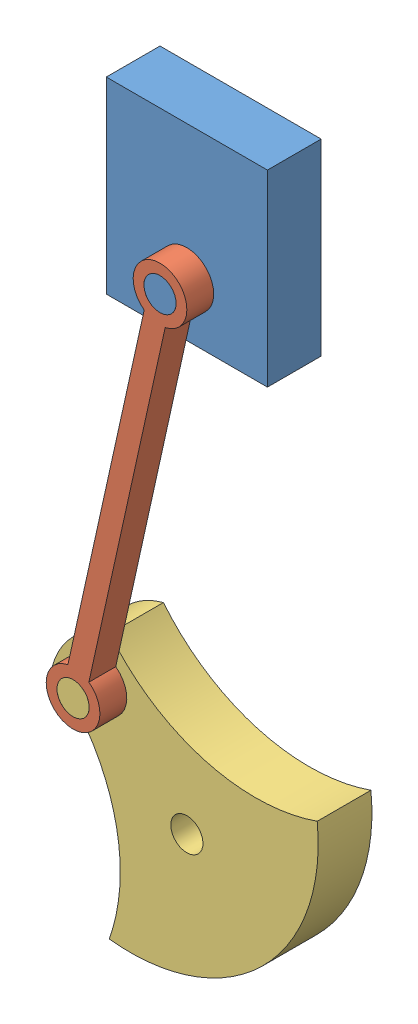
SolidWorks assembly c02_tut01.SLDASM, configuration Default (file format 15000). Lengths in mm.
Overall size (73.9 147.96 15).
3 component instances, 3 part files, 0 mates.
Components (placement in the parent):
- Block-Piston_tank-1-1-1: Block-Piston_tank-1-1.SLDPRT [Default] at (0 79.577 0) size (30 35 15)
- Block-Piston_rod-1-2-1: Block-Piston_rod-1-2.SLDPRT [Default] at (-16.1828 16.3437 0) x (0.976444 -0.215771 0) z (0 0 1) size (10 85 5)
- Block-Crank-1-3-1: Block-Crank-1-3.SLDPRT [Default] x (0.710597 0.7036 0) z (0 0 1) size (54.49 50 15)
